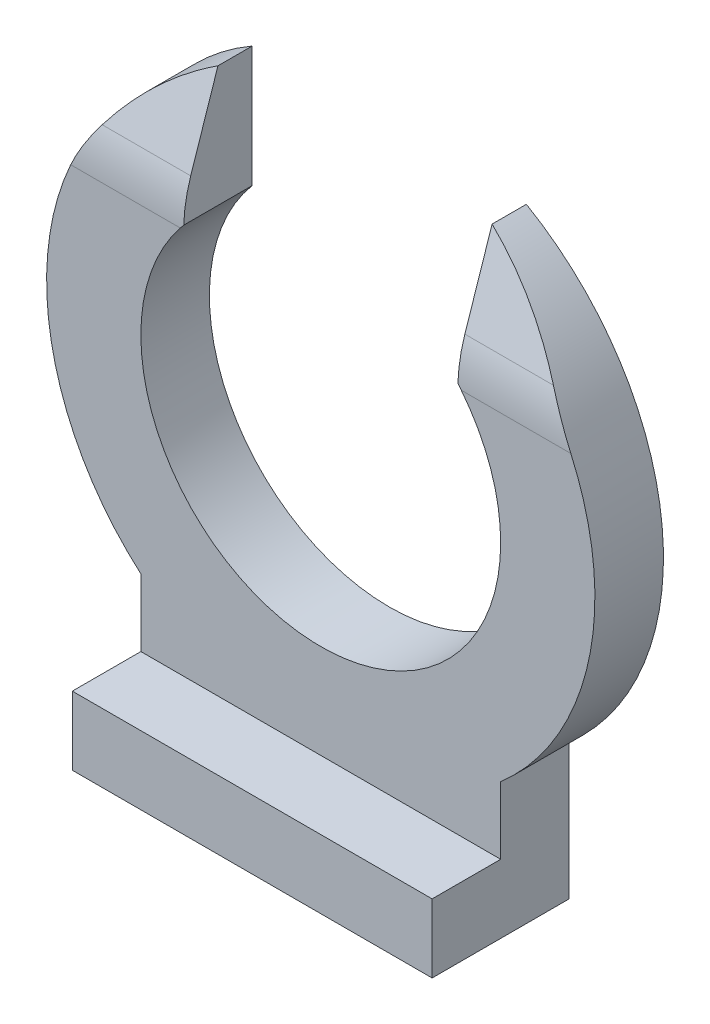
ISO-10303-21;
HEADER;
FILE_DESCRIPTION(('STEP AP214'),'2;1');
FILE_NAME('part.step','',(''),(''),'','','');
FILE_SCHEMA(('AUTOMOTIVE_DESIGN { 1 0 10303 214 1 1 1 1 }'));
ENDSEC;
DATA;
#1=APPLICATION_CONTEXT('core data for automotive mechanical design processes');
#2=APPLICATION_PROTOCOL_DEFINITION('international standard','automotive_design',2000,#1);
#3=PRODUCT_CONTEXT('',#1,'mechanical');
#4=PRODUCT('Part','Part','',(#3));
#5=PRODUCT_RELATED_PRODUCT_CATEGORY('part','',(#4));
#6=PRODUCT_DEFINITION_FORMATION('','',#4);
#7=PRODUCT_DEFINITION_CONTEXT('part definition',#1,'design');
#8=PRODUCT_DEFINITION('design','',#6,#7);
#9=PRODUCT_DEFINITION_SHAPE('','',#8);
#10=(LENGTH_UNIT() NAMED_UNIT(*) SI_UNIT(.MILLI.,.METRE.));
#11=(NAMED_UNIT(*) PLANE_ANGLE_UNIT() SI_UNIT($,.RADIAN.));
#12=(NAMED_UNIT(*) SI_UNIT($,.STERADIAN.) SOLID_ANGLE_UNIT());
#13=UNCERTAINTY_MEASURE_WITH_UNIT(LENGTH_MEASURE(1.E-05),#10,'distance_accuracy_value','');
#14=(GEOMETRIC_REPRESENTATION_CONTEXT(3) GLOBAL_UNCERTAINTY_ASSIGNED_CONTEXT((#13)) GLOBAL_UNIT_ASSIGNED_CONTEXT((#10,
#11,#12)) REPRESENTATION_CONTEXT('',''));
#15=CARTESIAN_POINT('',(0.,0.,0.));
#16=DIRECTION('',(0.,0.,1.));
#17=DIRECTION('',(1.,0.,0.));
#18=AXIS2_PLACEMENT_3D('',#15,#16,#17);
#19=CARTESIAN_POINT('',(0.,1.639546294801,-1.));
#20=DIRECTION('',(-1.,0.,0.));
#21=DIRECTION('',(0.,0.,1.));
#22=AXIS2_PLACEMENT_3D('',#19,#20,#21);
#23=CYLINDRICAL_SURFACE('',#22,2.);
#24=CARTESIAN_POINT('',(2.,1.70018381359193,0.999080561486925));
#25=CARTESIAN_POINT('',(2.00848403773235,1.69020369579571,0.99938514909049));
#26=CARTESIAN_POINT('',(2.01689298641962,1.68016051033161,0.999614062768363));
#27=CARTESIAN_POINT('',(2.03356070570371,1.65994800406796,0.999920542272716));
#28=CARTESIAN_POINT('',(2.04181947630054,1.64977868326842,0.999998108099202));
#29=CARTESIAN_POINT('',(2.05000315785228,1.639546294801,1.));
#30=B_SPLINE_CURVE_WITH_KNOTS('',3,(#24,#25,#26,#27,#28,#29),.UNSPECIFIED.,.F.,.F.,(4,2,4),(0.,
0.0393021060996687,0.078604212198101),.UNSPECIFIED.);
#31=CARTESIAN_POINT('',(2.,1.70018381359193,0.999080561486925));
#32=VERTEX_POINT('',#31);
#33=CARTESIAN_POINT('',(2.05000315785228,1.639546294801,1.));
#34=VERTEX_POINT('',#33);
#35=EDGE_CURVE('E345',#32,#34,#30,.T.);
#36=ORIENTED_EDGE('',*,*,#35,.T.);
#37=DIRECTION('',(1.,0.,0.));
#38=VECTOR('',#37,1.);
#39=CARTESIAN_POINT('',(0.,1.639546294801,1.));
#40=LINE('',#39,#38);
#41=CARTESIAN_POINT('',(3.64854600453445,1.639546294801,1.));
#42=VERTEX_POINT('',#41);
#43=EDGE_CURVE('E311',#42,#34,#40,.F.);
#44=ORIENTED_EDGE('',*,*,#43,.F.);
#45=CARTESIAN_POINT('',(3.64854600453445,1.639546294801,1.));
#46=CARTESIAN_POINT('',(3.62331166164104,1.69572540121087,1.00000404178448));
#47=CARTESIAN_POINT('',(3.59677272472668,1.75128992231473,0.99763373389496));
#48=CARTESIAN_POINT('',(3.54150239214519,1.86050032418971,0.988506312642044));
#49=CARTESIAN_POINT('',(3.51278625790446,1.91415627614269,0.981777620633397));
#50=CARTESIAN_POINT('',(3.45325155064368,2.019584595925,0.964288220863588));
#51=CARTESIAN_POINT('',(3.42243335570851,2.07135729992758,0.953528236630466));
#52=CARTESIAN_POINT('',(3.3587286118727,2.17315005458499,0.928220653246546));
#53=CARTESIAN_POINT('',(3.32582992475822,2.22315653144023,0.913648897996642));
#54=CARTESIAN_POINT('',(3.2921129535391,2.27200182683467,0.89736659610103));
#55=B_SPLINE_CURVE_WITH_KNOTS('',3,(#45,#46,#47,#48,#49,#50,#51,#52,#53,#54),.UNSPECIFIED.,.F.,
.F.,(4,2,2,2,4),(0.,0.184659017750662,0.368125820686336,0.551559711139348,0.736185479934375),.UNSPECIFIED.);
#56=CARTESIAN_POINT('',(3.2921129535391,2.27200182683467,0.897366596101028));
#57=VERTEX_POINT('',#56);
#58=EDGE_CURVE('E21',#42,#57,#55,.T.);
#59=ORIENTED_EDGE('',*,*,#58,.T.);
#60=DIRECTION('',(1.,0.,0.));
#61=VECTOR('',#60,1.);
#62=CARTESIAN_POINT('',(0.,2.27200182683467,0.897366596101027));
#63=LINE('',#62,#61);
#64=CARTESIAN_POINT('',(2.,2.27200182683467,0.897366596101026));
#65=VERTEX_POINT('',#64);
#66=EDGE_CURVE('E317',#57,#65,#63,.F.);
#67=ORIENTED_EDGE('',*,*,#66,.T.);
#68=CARTESIAN_POINT('',(2.,1.639546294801,-1.));
#69=DIRECTION('',(-1.,0.,0.));
#70=DIRECTION('',(0.,0.,1.));
#71=AXIS2_PLACEMENT_3D('',#68,#69,#70);
#72=CIRCLE('',#71,2.);
#73=EDGE_CURVE('E350',#65,#32,#72,.F.);
#74=ORIENTED_EDGE('',*,*,#73,.T.);
#75=EDGE_LOOP('',(#36,#44,#59,#67,#74));
#76=FACE_BOUND('',#75,.T.);
#77=ADVANCED_FACE('F17',(#76),#23,.T.);
#78=CARTESIAN_POINT('',(0.,1.639546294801,-1.));
#79=DIRECTION('',(-1.,0.,0.));
#80=DIRECTION('',(0.,0.,1.));
#81=AXIS2_PLACEMENT_3D('',#78,#79,#80);
#82=CYLINDRICAL_SURFACE('',#81,2.);
#83=CARTESIAN_POINT('',(-2.,1.639546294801,-1.));
#84=DIRECTION('',(-1.,0.,0.));
#85=DIRECTION('',(0.,0.,1.));
#86=AXIS2_PLACEMENT_3D('',#83,#84,#85);
#87=CIRCLE('',#86,2.);
#88=CARTESIAN_POINT('',(-2.,1.70018381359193,0.999080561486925));
#89=VERTEX_POINT('',#88);
#90=CARTESIAN_POINT('',(-2.,2.27200182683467,0.897366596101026));
#91=VERTEX_POINT('',#90);
#92=EDGE_CURVE('E151',#89,#91,#87,.T.);
#93=ORIENTED_EDGE('',*,*,#92,.T.);
#94=DIRECTION('',(1.,0.,0.));
#95=VECTOR('',#94,1.);
#96=CARTESIAN_POINT('',(0.,2.27200182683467,0.897366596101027));
#97=LINE('',#96,#95);
#98=CARTESIAN_POINT('',(-3.2921129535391,2.27200182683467,0.897366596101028));
#99=VERTEX_POINT('',#98);
#100=EDGE_CURVE('E314',#91,#99,#97,.F.);
#101=ORIENTED_EDGE('',*,*,#100,.T.);
#102=CARTESIAN_POINT('',(-3.2921129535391,2.27200182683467,0.89736659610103));
#103=CARTESIAN_POINT('',(-3.32582992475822,2.22315653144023,0.913648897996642));
#104=CARTESIAN_POINT('',(-3.3587286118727,2.17315005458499,0.928220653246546));
#105=CARTESIAN_POINT('',(-3.42243335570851,2.07135729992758,0.953528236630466));
#106=CARTESIAN_POINT('',(-3.45325155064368,2.019584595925,0.964288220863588));
#107=CARTESIAN_POINT('',(-3.51278625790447,1.91415627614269,0.981777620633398));
#108=CARTESIAN_POINT('',(-3.54150239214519,1.86050032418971,0.988506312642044));
#109=CARTESIAN_POINT('',(-3.59677272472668,1.75128992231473,0.99763373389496));
#110=CARTESIAN_POINT('',(-3.62331166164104,1.69572540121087,1.00000404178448));
#111=CARTESIAN_POINT('',(-3.64854600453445,1.639546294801,1.));
#112=B_SPLINE_CURVE_WITH_KNOTS('',3,(#102,#103,#104,#105,#106,#107,#108,#109,#110,#111),
.UNSPECIFIED.,.F.,.F.,(4,2,2,2,4),(0.,0.184625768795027,0.368059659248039,0.551526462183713,
0.736185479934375),.UNSPECIFIED.);
#113=CARTESIAN_POINT('',(-3.64854600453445,1.639546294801,1.));
#114=VERTEX_POINT('',#113);
#115=EDGE_CURVE('E216',#99,#114,#112,.T.);
#116=ORIENTED_EDGE('',*,*,#115,.T.);
#117=DIRECTION('',(1.,0.,0.));
#118=VECTOR('',#117,1.);
#119=CARTESIAN_POINT('',(0.,1.639546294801,1.));
#120=LINE('',#119,#118);
#121=CARTESIAN_POINT('',(-2.05000315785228,1.639546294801,1.));
#122=VERTEX_POINT('',#121);
#123=EDGE_CURVE('E140',#122,#114,#120,.F.);
#124=ORIENTED_EDGE('',*,*,#123,.F.);
#125=CARTESIAN_POINT('',(-2.05000315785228,1.639546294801,1.));
#126=CARTESIAN_POINT('',(-2.04181947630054,1.64977868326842,0.999998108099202));
#127=CARTESIAN_POINT('',(-2.03356070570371,1.65994800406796,0.999920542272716));
#128=CARTESIAN_POINT('',(-2.01689298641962,1.68016051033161,0.999614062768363));
#129=CARTESIAN_POINT('',(-2.00848403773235,1.69020369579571,0.999385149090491));
#130=CARTESIAN_POINT('',(-2.,1.70018381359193,0.999080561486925));
#131=B_SPLINE_CURVE_WITH_KNOTS('',3,(#125,#126,#127,#128,#129,#130),.UNSPECIFIED.,.F.,.F.,(4,2,
4),(0.,0.0393021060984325,0.0786042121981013),.UNSPECIFIED.);
#132=EDGE_CURVE('E209',#122,#89,#131,.T.);
#133=ORIENTED_EDGE('',*,*,#132,.T.);
#134=EDGE_LOOP('',(#93,#101,#116,#124,#133));
#135=FACE_BOUND('',#134,.T.);
#136=ADVANCED_FACE('F227',(#135),#82,.T.);
#137=CARTESIAN_POINT('',(2.625,-4.00000005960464,0.));
#138=DIRECTION('',(0.,1.,0.));
#139=DIRECTION('',(0.,0.,1.));
#140=AXIS2_PLACEMENT_3D('',#137,#138,#139);
#141=PLANE('',#140);
#142=DIRECTION('',(1.,0.,0.));
#143=VECTOR('',#142,1.);
#144=CARTESIAN_POINT('',(0.,-4.00000005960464,2.));
#145=LINE('',#144,#143);
#146=CARTESIAN_POINT('',(2.625,-4.00000005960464,2.));
#147=VERTEX_POINT('',#146);
#148=CARTESIAN_POINT('',(-2.625,-4.00000005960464,2.));
#149=VERTEX_POINT('',#148);
#150=EDGE_CURVE('E166',#147,#149,#145,.F.);
#151=ORIENTED_EDGE('',*,*,#150,.F.);
#152=DIRECTION('',(0.,0.,1.));
#153=VECTOR('',#152,1.);
#154=CARTESIAN_POINT('',(2.625,-4.00000005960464,0.));
#155=LINE('',#154,#153);
#156=CARTESIAN_POINT('',(2.625,-4.00000005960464,1.));
#157=VERTEX_POINT('',#156);
#158=EDGE_CURVE('E150',#147,#157,#155,.F.);
#159=ORIENTED_EDGE('',*,*,#158,.T.);
#160=DIRECTION('',(1.,0.,0.));
#161=VECTOR('',#160,1.);
#162=CARTESIAN_POINT('',(0.,-4.00000005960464,1.));
#163=LINE('',#162,#161);
#164=CARTESIAN_POINT('',(-2.625,-4.00000005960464,1.));
#165=VERTEX_POINT('',#164);
#166=EDGE_CURVE('E135',#165,#157,#163,.T.);
#167=ORIENTED_EDGE('',*,*,#166,.F.);
#168=DIRECTION('',(0.,0.,1.));
#169=VECTOR('',#168,1.);
#170=CARTESIAN_POINT('',(-2.625,-4.00000005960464,0.));
#171=LINE('',#170,#169);
#172=EDGE_CURVE('E143',#165,#149,#171,.T.);
#173=ORIENTED_EDGE('',*,*,#172,.T.);
#174=EDGE_LOOP('',(#151,#159,#167,#173));
#175=FACE_BOUND('',#174,.T.);
#176=ADVANCED_FACE('F153',(#175),#141,.T.);
#177=CARTESIAN_POINT('',(0.,-4.50000006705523,2.));
#178=DIRECTION('',(0.,0.,1.));
#179=DIRECTION('',(1.,0.,0.));
#180=AXIS2_PLACEMENT_3D('',#177,#178,#179);
#181=PLANE('',#180);
#182=DIRECTION('',(0.,1.,0.));
#183=VECTOR('',#182,1.);
#184=CARTESIAN_POINT('',(2.625,-4.50000006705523,2.));
#185=LINE('',#184,#183);
#186=CARTESIAN_POINT('',(2.625,-5.00000007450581,2.));
#187=VERTEX_POINT('',#186);
#188=EDGE_CURVE('E114',#187,#147,#185,.T.);
#189=ORIENTED_EDGE('',*,*,#188,.T.);
#190=ORIENTED_EDGE('',*,*,#150,.T.);
#191=DIRECTION('',(0.,1.,0.));
#192=VECTOR('',#191,1.);
#193=CARTESIAN_POINT('',(-2.625,-4.50000006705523,2.));
#194=LINE('',#193,#192);
#195=CARTESIAN_POINT('',(-2.625,-5.00000007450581,2.));
#196=VERTEX_POINT('',#195);
#197=EDGE_CURVE('E146',#149,#196,#194,.F.);
#198=ORIENTED_EDGE('',*,*,#197,.T.);
#199=DIRECTION('',(1.,0.,0.));
#200=VECTOR('',#199,1.);
#201=CARTESIAN_POINT('',(-2.625,-5.00000007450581,2.));
#202=LINE('',#201,#200);
#203=EDGE_CURVE('E154',#187,#196,#202,.F.);
#204=ORIENTED_EDGE('',*,*,#203,.F.);
#205=EDGE_LOOP('',(#189,#190,#198,#204));
#206=FACE_BOUND('',#205,.T.);
#207=ADVANCED_FACE('F235',(#206),#181,.T.);
#208=CARTESIAN_POINT('',(0.,1.96410161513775,1.));
#209=DIRECTION('',(0.,-0.316227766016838,-0.948683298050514));
#210=DIRECTION('',(0.,0.948683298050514,-0.316227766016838));
#211=AXIS2_PLACEMENT_3D('',#208,#209,#210);
#212=PLANE('',#211);
#213=CARTESIAN_POINT('',(0.,0.,1.65470053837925));
#214=DIRECTION('',(0.,-0.316227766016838,-0.948683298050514));
#215=DIRECTION('',(0.,-0.948683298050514,0.316227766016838));
#216=AXIS2_PLACEMENT_3D('',#213,#214,#215);
#217=ELLIPSE('',#216,4.21637021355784,4.);
#218=CARTESIAN_POINT('',(2.,3.46410161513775,0.5));
#219=VERTEX_POINT('',#218);
#220=EDGE_CURVE('E202',#219,#57,#217,.T.);
#221=ORIENTED_EDGE('',*,*,#220,.F.);
#222=DIRECTION('',(0.,0.948683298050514,-0.316227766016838));
#223=VECTOR('',#222,1.);
#224=CARTESIAN_POINT('',(2.,1.96410161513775,1.));
#225=LINE('',#224,#223);
#226=EDGE_CURVE('E178',#65,#219,#225,.T.);
#227=ORIENTED_EDGE('',*,*,#226,.F.);
#228=ORIENTED_EDGE('',*,*,#66,.F.);
#229=EDGE_LOOP('',(#221,#227,#228));
#230=FACE_BOUND('',#229,.T.);
#231=ADVANCED_FACE('F238',(#230),#212,.F.);
#232=CARTESIAN_POINT('',(0.,1.96410161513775,1.));
#233=DIRECTION('',(0.,-0.316227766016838,-0.948683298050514));
#234=DIRECTION('',(0.,0.948683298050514,-0.316227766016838));
#235=AXIS2_PLACEMENT_3D('',#232,#233,#234);
#236=PLANE('',#235);
#237=DIRECTION('',(0.,-0.948683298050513,0.316227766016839));
#238=VECTOR('',#237,1.);
#239=CARTESIAN_POINT('',(-2.,3.46410161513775,0.5));
#240=LINE('',#239,#238);
#241=CARTESIAN_POINT('',(-2.,3.46410161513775,0.499999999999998));
#242=VERTEX_POINT('',#241);
#243=EDGE_CURVE('E196',#242,#91,#240,.T.);
#244=ORIENTED_EDGE('',*,*,#243,.F.);
#245=CARTESIAN_POINT('',(0.,0.,1.65470053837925));
#246=DIRECTION('',(0.,-0.316227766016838,-0.948683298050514));
#247=DIRECTION('',(0.,-0.948683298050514,0.316227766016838));
#248=AXIS2_PLACEMENT_3D('',#245,#246,#247);
#249=ELLIPSE('',#248,4.21637021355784,4.);
#250=EDGE_CURVE('E194',#99,#242,#249,.T.);
#251=ORIENTED_EDGE('',*,*,#250,.F.);
#252=ORIENTED_EDGE('',*,*,#100,.F.);
#253=EDGE_LOOP('',(#244,#251,#252));
#254=FACE_BOUND('',#253,.T.);
#255=ADVANCED_FACE('F242',(#254),#236,.F.);
#256=CARTESIAN_POINT('',(0.,-0.767949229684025,1.));
#257=DIRECTION('',(0.,0.,1.));
#258=DIRECTION('',(1.,0.,0.));
#259=AXIS2_PLACEMENT_3D('',#256,#257,#258);
#260=PLANE('',#259);
#261=DIRECTION('',(0.,1.,0.));
#262=VECTOR('',#261,1.);
#263=CARTESIAN_POINT('',(2.625,-5.00000007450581,1.));
#264=LINE('',#263,#262);
#265=CARTESIAN_POINT('',(2.625,-3.01817411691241,1.));
#266=VERTEX_POINT('',#265);
#267=EDGE_CURVE('E157',#266,#157,#264,.F.);
#268=ORIENTED_EDGE('',*,*,#267,.F.);
#269=CARTESIAN_POINT('',(0.,0.,1.));
#270=DIRECTION('',(0.,0.,1.));
#271=DIRECTION('',(1.,0.,0.));
#272=AXIS2_PLACEMENT_3D('',#269,#270,#271);
#273=CIRCLE('',#272,4.);
#274=EDGE_CURVE('E205',#42,#266,#273,.F.);
#275=ORIENTED_EDGE('',*,*,#274,.F.);
#276=ORIENTED_EDGE('',*,*,#43,.T.);
#277=CARTESIAN_POINT('',(0.,0.,1.));
#278=DIRECTION('',(0.,0.,1.));
#279=DIRECTION('',(1.,0.,0.));
#280=AXIS2_PLACEMENT_3D('',#277,#278,#279);
#281=CIRCLE('',#280,2.625);
#282=EDGE_CURVE('E197',#34,#122,#281,.F.);
#283=ORIENTED_EDGE('',*,*,#282,.T.);
#284=ORIENTED_EDGE('',*,*,#123,.T.);
#285=CARTESIAN_POINT('',(0.,0.,1.));
#286=DIRECTION('',(0.,0.,1.));
#287=DIRECTION('',(1.,0.,0.));
#288=AXIS2_PLACEMENT_3D('',#285,#286,#287);
#289=CIRCLE('',#288,4.);
#290=CARTESIAN_POINT('',(-2.625,-3.01817411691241,1.));
#291=VERTEX_POINT('',#290);
#292=EDGE_CURVE('E139',#291,#114,#289,.F.);
#293=ORIENTED_EDGE('',*,*,#292,.F.);
#294=DIRECTION('',(0.,1.,0.));
#295=VECTOR('',#294,1.);
#296=CARTESIAN_POINT('',(-2.625,-0.767949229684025,1.));
#297=LINE('',#296,#295);
#298=EDGE_CURVE('E130',#291,#165,#297,.F.);
#299=ORIENTED_EDGE('',*,*,#298,.T.);
#300=ORIENTED_EDGE('',*,*,#166,.T.);
#301=EDGE_LOOP('',(#268,#275,#276,#283,#284,#293,#299,#300));
#302=FACE_BOUND('',#301,.T.);
#303=ADVANCED_FACE('F133',(#302),#260,.T.);
#304=CARTESIAN_POINT('',(-2.625,-5.00000007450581,0.));
#305=DIRECTION('',(0.,-1.,0.));
#306=DIRECTION('',(0.,0.,-1.));
#307=AXIS2_PLACEMENT_3D('',#304,#305,#306);
#308=PLANE('',#307);
#309=ORIENTED_EDGE('',*,*,#203,.T.);
#310=DIRECTION('',(0.,0.,1.));
#311=VECTOR('',#310,1.);
#312=CARTESIAN_POINT('',(-2.625,-5.00000007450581,0.));
#313=LINE('',#312,#311);
#314=CARTESIAN_POINT('',(-2.625,-5.00000007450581,0.));
#315=VERTEX_POINT('',#314);
#316=EDGE_CURVE('E333',#315,#196,#313,.T.);
#317=ORIENTED_EDGE('',*,*,#316,.F.);
#318=DIRECTION('',(1.,0.,0.));
#319=VECTOR('',#318,1.);
#320=CARTESIAN_POINT('',(0.,-5.00000007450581,0.));
#321=LINE('',#320,#319);
#322=CARTESIAN_POINT('',(2.625,-5.00000007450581,0.));
#323=VERTEX_POINT('',#322);
#324=EDGE_CURVE('E331',#315,#323,#321,.T.);
#325=ORIENTED_EDGE('',*,*,#324,.T.);
#326=DIRECTION('',(0.,0.,-1.));
#327=VECTOR('',#326,1.);
#328=CARTESIAN_POINT('',(2.625,-5.00000007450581,0.));
#329=LINE('',#328,#327);
#330=EDGE_CURVE('E207',#187,#323,#329,.T.);
#331=ORIENTED_EDGE('',*,*,#330,.F.);
#332=EDGE_LOOP('',(#309,#317,#325,#331));
#333=FACE_BOUND('',#332,.T.);
#334=ADVANCED_FACE('F249',(#333),#308,.T.);
#335=CARTESIAN_POINT('',(2.625,-5.00000007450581,0.));
#336=DIRECTION('',(1.,0.,0.));
#337=DIRECTION('',(0.,0.,-1.));
#338=AXIS2_PLACEMENT_3D('',#335,#336,#337);
#339=PLANE('',#338);
#340=ORIENTED_EDGE('',*,*,#188,.F.);
#341=ORIENTED_EDGE('',*,*,#330,.T.);
#342=DIRECTION('',(0.,1.,0.));
#343=VECTOR('',#342,1.);
#344=CARTESIAN_POINT('',(2.625,-0.767949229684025,0.));
#345=LINE('',#344,#343);
#346=CARTESIAN_POINT('',(2.625,-3.01817411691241,0.));
#347=VERTEX_POINT('',#346);
#348=EDGE_CURVE('E191',#323,#347,#345,.T.);
#349=ORIENTED_EDGE('',*,*,#348,.T.);
#350=DIRECTION('',(0.,0.,1.));
#351=VECTOR('',#350,1.);
#352=CARTESIAN_POINT('',(2.625,-3.01817411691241,0.));
#353=LINE('',#352,#351);
#354=EDGE_CURVE('E204',#266,#347,#353,.F.);
#355=ORIENTED_EDGE('',*,*,#354,.F.);
#356=ORIENTED_EDGE('',*,*,#267,.T.);
#357=ORIENTED_EDGE('',*,*,#158,.F.);
#358=EDGE_LOOP('',(#340,#341,#349,#355,#356,#357));
#359=FACE_BOUND('',#358,.T.);
#360=ADVANCED_FACE('F252',(#359),#339,.T.);
#361=CARTESIAN_POINT('',(0.,0.,0.));
#362=DIRECTION('',(0.,0.,1.));
#363=DIRECTION('',(1.,0.,0.));
#364=AXIS2_PLACEMENT_3D('',#361,#362,#363);
#365=CYLINDRICAL_SURFACE('',#364,4.);
#366=DIRECTION('',(0.,0.,1.));
#367=VECTOR('',#366,1.);
#368=CARTESIAN_POINT('',(2.,3.46410161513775,0.));
#369=LINE('',#368,#367);
#370=CARTESIAN_POINT('',(2.,3.46410161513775,0.));
#371=VERTEX_POINT('',#370);
#372=EDGE_CURVE('E201',#219,#371,#369,.F.);
#373=ORIENTED_EDGE('',*,*,#372,.F.);
#374=ORIENTED_EDGE('',*,*,#220,.T.);
#375=ORIENTED_EDGE('',*,*,#58,.F.);
#376=ORIENTED_EDGE('',*,*,#274,.T.);
#377=ORIENTED_EDGE('',*,*,#354,.T.);
#378=CARTESIAN_POINT('',(0.,0.,0.));
#379=DIRECTION('',(0.,0.,1.));
#380=DIRECTION('',(1.,0.,0.));
#381=AXIS2_PLACEMENT_3D('',#378,#379,#380);
#382=CIRCLE('',#381,4.);
#383=EDGE_CURVE('E188',#347,#371,#382,.T.);
#384=ORIENTED_EDGE('',*,*,#383,.T.);
#385=EDGE_LOOP('',(#373,#374,#375,#376,#377,#384));
#386=FACE_BOUND('',#385,.T.);
#387=ADVANCED_FACE('F255',(#386),#365,.T.);
#388=CARTESIAN_POINT('',(2.,3.46410161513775,0.));
#389=DIRECTION('',(-1.,0.,0.));
#390=DIRECTION('',(0.,-1.,0.));
#391=AXIS2_PLACEMENT_3D('',#388,#389,#390);
#392=PLANE('',#391);
#393=DIRECTION('',(0.,1.,0.));
#394=VECTOR('',#393,1.);
#395=CARTESIAN_POINT('',(2.,-0.767949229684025,0.));
#396=LINE('',#395,#394);
#397=CARTESIAN_POINT('',(2.,1.70018381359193,0.));
#398=VERTEX_POINT('',#397);
#399=EDGE_CURVE('E187',#371,#398,#396,.F.);
#400=ORIENTED_EDGE('',*,*,#399,.T.);
#401=DIRECTION('',(0.,0.,1.));
#402=VECTOR('',#401,1.);
#403=CARTESIAN_POINT('',(2.,1.70018381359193,0.));
#404=LINE('',#403,#402);
#405=EDGE_CURVE('E200',#398,#32,#404,.T.);
#406=ORIENTED_EDGE('',*,*,#405,.T.);
#407=ORIENTED_EDGE('',*,*,#73,.F.);
#408=ORIENTED_EDGE('',*,*,#226,.T.);
#409=ORIENTED_EDGE('',*,*,#372,.T.);
#410=EDGE_LOOP('',(#400,#406,#407,#408,#409));
#411=FACE_BOUND('',#410,.T.);
#412=ADVANCED_FACE('F258',(#411),#392,.T.);
#413=CARTESIAN_POINT('',(0.,0.,0.));
#414=DIRECTION('',(0.,0.,1.));
#415=DIRECTION('',(1.,0.,0.));
#416=AXIS2_PLACEMENT_3D('',#413,#414,#415);
#417=CYLINDRICAL_SURFACE('',#416,2.625);
#418=ORIENTED_EDGE('',*,*,#405,.F.);
#419=CARTESIAN_POINT('',(0.,0.,0.));
#420=DIRECTION('',(0.,0.,1.));
#421=DIRECTION('',(1.,0.,0.));
#422=AXIS2_PLACEMENT_3D('',#419,#420,#421);
#423=CIRCLE('',#422,2.625);
#424=CARTESIAN_POINT('',(-2.,1.70018381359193,0.));
#425=VERTEX_POINT('',#424);
#426=EDGE_CURVE('E184',#398,#425,#423,.F.);
#427=ORIENTED_EDGE('',*,*,#426,.T.);
#428=DIRECTION('',(0.,0.,1.));
#429=VECTOR('',#428,1.);
#430=CARTESIAN_POINT('',(-2.,1.70018381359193,0.));
#431=LINE('',#430,#429);
#432=EDGE_CURVE('E297',#89,#425,#431,.F.);
#433=ORIENTED_EDGE('',*,*,#432,.F.);
#434=ORIENTED_EDGE('',*,*,#132,.F.);
#435=ORIENTED_EDGE('',*,*,#282,.F.);
#436=ORIENTED_EDGE('',*,*,#35,.F.);
#437=EDGE_LOOP('',(#418,#427,#433,#434,#435,#436));
#438=FACE_BOUND('',#437,.T.);
#439=ADVANCED_FACE('F223',(#438),#417,.F.);
#440=CARTESIAN_POINT('',(-2.,1.70018381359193,0.));
#441=DIRECTION('',(1.,0.,0.));
#442=DIRECTION('',(0.,1.,0.));
#443=AXIS2_PLACEMENT_3D('',#440,#441,#442);
#444=PLANE('',#443);
#445=DIRECTION('',(0.,0.,1.));
#446=VECTOR('',#445,1.);
#447=CARTESIAN_POINT('',(-2.,3.46410161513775,0.));
#448=LINE('',#447,#446);
#449=CARTESIAN_POINT('',(-2.,3.46410161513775,0.));
#450=VERTEX_POINT('',#449);
#451=EDGE_CURVE('E193',#242,#450,#448,.F.);
#452=ORIENTED_EDGE('',*,*,#451,.F.);
#453=ORIENTED_EDGE('',*,*,#243,.T.);
#454=ORIENTED_EDGE('',*,*,#92,.F.);
#455=ORIENTED_EDGE('',*,*,#432,.T.);
#456=DIRECTION('',(0.,1.,0.));
#457=VECTOR('',#456,1.);
#458=CARTESIAN_POINT('',(-2.,-0.767949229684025,0.));
#459=LINE('',#458,#457);
#460=EDGE_CURVE('E183',#425,#450,#459,.T.);
#461=ORIENTED_EDGE('',*,*,#460,.T.);
#462=EDGE_LOOP('',(#452,#453,#454,#455,#461));
#463=FACE_BOUND('',#462,.T.);
#464=ADVANCED_FACE('F265',(#463),#444,.T.);
#465=CARTESIAN_POINT('',(0.,0.,0.));
#466=DIRECTION('',(0.,0.,1.));
#467=DIRECTION('',(1.,0.,0.));
#468=AXIS2_PLACEMENT_3D('',#465,#466,#467);
#469=CYLINDRICAL_SURFACE('',#468,4.);
#470=DIRECTION('',(0.,0.,1.));
#471=VECTOR('',#470,1.);
#472=CARTESIAN_POINT('',(-2.625,-3.01817411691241,0.));
#473=LINE('',#472,#471);
#474=CARTESIAN_POINT('',(-2.625,-3.01817411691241,0.));
#475=VERTEX_POINT('',#474);
#476=EDGE_CURVE('E40',#291,#475,#473,.F.);
#477=ORIENTED_EDGE('',*,*,#476,.F.);
#478=ORIENTED_EDGE('',*,*,#292,.T.);
#479=ORIENTED_EDGE('',*,*,#115,.F.);
#480=ORIENTED_EDGE('',*,*,#250,.T.);
#481=ORIENTED_EDGE('',*,*,#451,.T.);
#482=CARTESIAN_POINT('',(0.,0.,0.));
#483=DIRECTION('',(0.,0.,1.));
#484=DIRECTION('',(1.,0.,0.));
#485=AXIS2_PLACEMENT_3D('',#482,#483,#484);
#486=CIRCLE('',#485,4.);
#487=EDGE_CURVE('E32',#450,#475,#486,.T.);
#488=ORIENTED_EDGE('',*,*,#487,.T.);
#489=EDGE_LOOP('',(#477,#478,#479,#480,#481,#488));
#490=FACE_BOUND('',#489,.T.);
#491=ADVANCED_FACE('F275',(#490),#469,.T.);
#492=CARTESIAN_POINT('',(-2.625,-3.01817411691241,0.));
#493=DIRECTION('',(-1.,0.,0.));
#494=DIRECTION('',(0.,0.,1.));
#495=AXIS2_PLACEMENT_3D('',#492,#493,#494);
#496=PLANE('',#495);
#497=ORIENTED_EDGE('',*,*,#197,.F.);
#498=ORIENTED_EDGE('',*,*,#172,.F.);
#499=ORIENTED_EDGE('',*,*,#298,.F.);
#500=ORIENTED_EDGE('',*,*,#476,.T.);
#501=DIRECTION('',(0.,1.,0.));
#502=VECTOR('',#501,1.);
#503=CARTESIAN_POINT('',(-2.625,-0.767949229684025,0.));
#504=LINE('',#503,#502);
#505=EDGE_CURVE('E11',#475,#315,#504,.F.);
#506=ORIENTED_EDGE('',*,*,#505,.T.);
#507=ORIENTED_EDGE('',*,*,#316,.T.);
#508=EDGE_LOOP('',(#497,#498,#499,#500,#506,#507));
#509=FACE_BOUND('',#508,.T.);
#510=ADVANCED_FACE('F144',(#509),#496,.T.);
#511=CARTESIAN_POINT('',(0.,-0.767949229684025,0.));
#512=DIRECTION('',(0.,0.,1.));
#513=DIRECTION('',(1.,0.,0.));
#514=AXIS2_PLACEMENT_3D('',#511,#512,#513);
#515=PLANE('',#514);
#516=ORIENTED_EDGE('',*,*,#487,.F.);
#517=ORIENTED_EDGE('',*,*,#460,.F.);
#518=ORIENTED_EDGE('',*,*,#426,.F.);
#519=ORIENTED_EDGE('',*,*,#399,.F.);
#520=ORIENTED_EDGE('',*,*,#383,.F.);
#521=ORIENTED_EDGE('',*,*,#348,.F.);
#522=ORIENTED_EDGE('',*,*,#324,.F.);
#523=ORIENTED_EDGE('',*,*,#505,.F.);
#524=EDGE_LOOP('',(#516,#517,#518,#519,#520,#521,#522,#523));
#525=FACE_BOUND('',#524,.T.);
#526=ADVANCED_FACE('F268',(#525),#515,.F.);
#527=CLOSED_SHELL('',(#77,#136,#176,#207,#231,#255,#303,#334,#360,#387,#412,#439,#464,#491,#510,#526));
#528=MANIFOLD_SOLID_BREP('B1',#527);
#529=ADVANCED_BREP_SHAPE_REPRESENTATION('',(#18,#528),#14);
#530=SHAPE_DEFINITION_REPRESENTATION(#9,#529);
ENDSEC;
END-ISO-10303-21;
